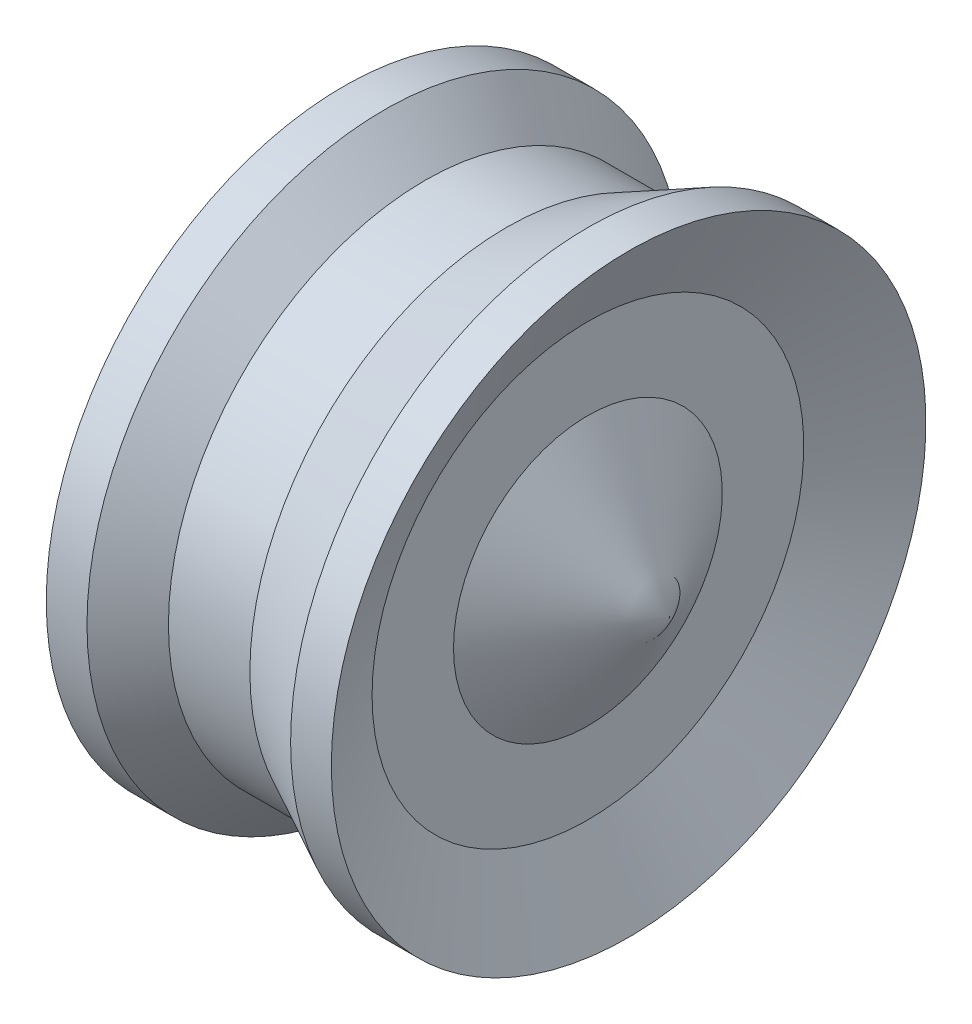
from build123d import *


with BuildPart() as part:
    # Esquisse1 → Base-R_volution (revolve)
    with BuildSketch(Plane.XY, mode=Mode.PRIVATE) as base_r_volution_sk:
        Polygon((0, 0), (0, -2), (-0.5, -2), (-0.5, -1.5), (-2, -1.5), (-2, -3.65), (-1.5, -3.65), (-1, -3.15), (0, -3.15), (1, -3.65), (1.5, -3.65), (1, -2.65), (1, -1.65), (2, 0), align=None)
    revolve(base_r_volution_sk.sketch.rotate(Axis((0, 0, 0), (1, 0, 0)), 270), axis=Axis((0, 0, 0), (1, 0, 0)))


solid = part.part
